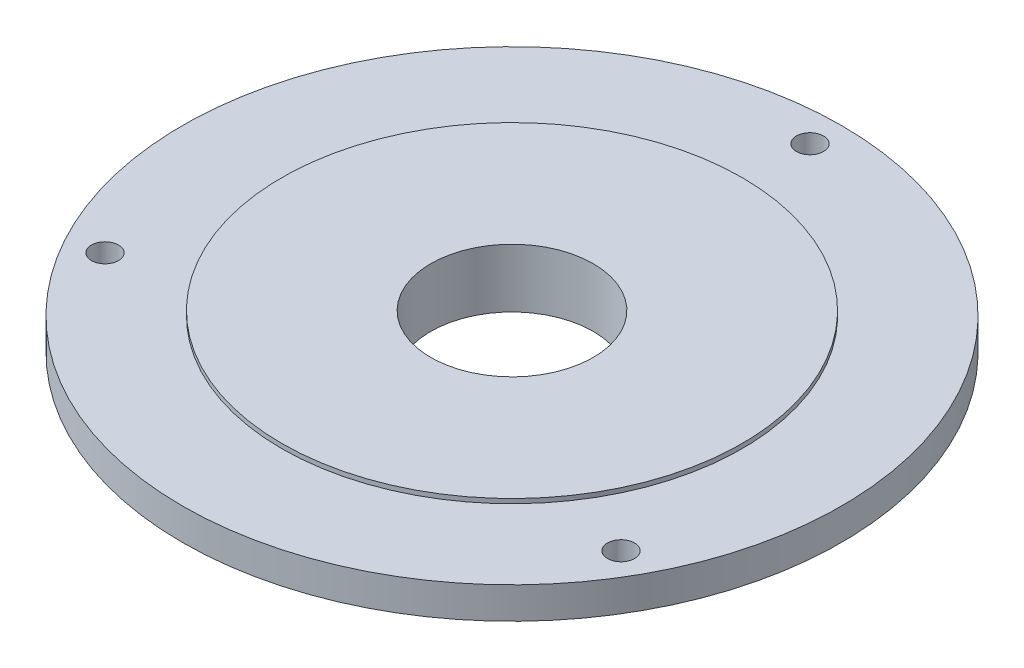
ISO-10303-21;
HEADER;
FILE_DESCRIPTION(('STEP AP214'),'2;1');
FILE_NAME('part.step','',(''),(''),'','','');
FILE_SCHEMA(('AUTOMOTIVE_DESIGN { 1 0 10303 214 1 1 1 1 }'));
ENDSEC;
DATA;
#1=APPLICATION_CONTEXT('core data for automotive mechanical design processes');
#2=APPLICATION_PROTOCOL_DEFINITION('international standard','automotive_design',2000,#1);
#3=PRODUCT_CONTEXT('',#1,'mechanical');
#4=PRODUCT('Part','Part','',(#3));
#5=PRODUCT_RELATED_PRODUCT_CATEGORY('part','',(#4));
#6=PRODUCT_DEFINITION_FORMATION('','',#4);
#7=PRODUCT_DEFINITION_CONTEXT('part definition',#1,'design');
#8=PRODUCT_DEFINITION('design','',#6,#7);
#9=PRODUCT_DEFINITION_SHAPE('','',#8);
#10=(LENGTH_UNIT() NAMED_UNIT(*) SI_UNIT(.MILLI.,.METRE.));
#11=(NAMED_UNIT(*) PLANE_ANGLE_UNIT() SI_UNIT($,.RADIAN.));
#12=(NAMED_UNIT(*) SI_UNIT($,.STERADIAN.) SOLID_ANGLE_UNIT());
#13=UNCERTAINTY_MEASURE_WITH_UNIT(LENGTH_MEASURE(1.E-05),#10,'distance_accuracy_value','');
#14=(GEOMETRIC_REPRESENTATION_CONTEXT(3) GLOBAL_UNCERTAINTY_ASSIGNED_CONTEXT((#13)) GLOBAL_UNIT_ASSIGNED_CONTEXT((#10,
#11,#12)) REPRESENTATION_CONTEXT('',''));
#15=CARTESIAN_POINT('',(0.,0.,0.));
#16=DIRECTION('',(0.,0.,1.));
#17=DIRECTION('',(1.,0.,0.));
#18=AXIS2_PLACEMENT_3D('',#15,#16,#17);
#19=CARTESIAN_POINT('',(0.,0.,0.));
#20=DIRECTION('',(0.,-1.,0.));
#21=DIRECTION('',(0.,0.,-1.));
#22=AXIS2_PLACEMENT_3D('',#19,#20,#21);
#23=CYLINDRICAL_SURFACE('',#22,25.5);
#24=CARTESIAN_POINT('',(0.,38.3859311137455,0.));
#25=DIRECTION('',(0.,-1.,0.));
#26=DIRECTION('',(0.,0.,-1.));
#27=AXIS2_PLACEMENT_3D('',#24,#25,#26);
#28=CIRCLE('',#27,25.5);
#29=CARTESIAN_POINT('',(0.,38.3859311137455,-25.5));
#30=VERTEX_POINT('',#29);
#31=EDGE_CURVE('E10',#30,#30,#28,.T.);
#32=ORIENTED_EDGE('',*,*,#31,.T.);
#33=EDGE_LOOP('',(#32));
#34=FACE_BOUND('',#33,.T.);
#35=CARTESIAN_POINT('',(0.,37.8859311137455,0.));
#36=DIRECTION('',(0.,-1.,0.));
#37=DIRECTION('',(0.,0.,-1.));
#38=AXIS2_PLACEMENT_3D('',#35,#36,#37);
#39=CIRCLE('',#38,25.5);
#40=CARTESIAN_POINT('',(0.,37.8859311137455,-25.5));
#41=VERTEX_POINT('',#40);
#42=EDGE_CURVE('E72',#41,#41,#39,.T.);
#43=ORIENTED_EDGE('',*,*,#42,.F.);
#44=EDGE_LOOP('',(#43));
#45=FACE_BOUND('',#44,.T.);
#46=ADVANCED_FACE('F37',(#34,#45),#23,.T.);
#47=CARTESIAN_POINT('',(9.,38.3859311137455,0.));
#48=DIRECTION('',(0.,1.,0.));
#49=DIRECTION('',(0.,0.,1.));
#50=AXIS2_PLACEMENT_3D('',#47,#48,#49);
#51=PLANE('',#50);
#52=CARTESIAN_POINT('',(0.,38.3859311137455,0.));
#53=DIRECTION('',(0.,-1.,0.));
#54=DIRECTION('',(0.,0.,-1.));
#55=AXIS2_PLACEMENT_3D('',#52,#53,#54);
#56=CIRCLE('',#55,9.);
#57=CARTESIAN_POINT('',(0.,38.3859311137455,-9.));
#58=VERTEX_POINT('',#57);
#59=EDGE_CURVE('E44',#58,#58,#56,.T.);
#60=ORIENTED_EDGE('',*,*,#59,.T.);
#61=EDGE_LOOP('',(#60));
#62=FACE_BOUND('',#61,.T.);
#63=ORIENTED_EDGE('',*,*,#31,.F.);
#64=EDGE_LOOP('',(#63));
#65=FACE_BOUND('',#64,.T.);
#66=ADVANCED_FACE('F144',(#62,#65),#51,.T.);
#67=CARTESIAN_POINT('',(0.,0.,0.));
#68=DIRECTION('',(0.,-1.,0.));
#69=DIRECTION('',(0.,0.,-1.));
#70=AXIS2_PLACEMENT_3D('',#67,#68,#69);
#71=CYLINDRICAL_SURFACE('',#70,9.);
#72=CARTESIAN_POINT('',(0.,31.8859311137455,0.));
#73=DIRECTION('',(0.,-1.,0.));
#74=DIRECTION('',(0.,0.,-1.));
#75=AXIS2_PLACEMENT_3D('',#72,#73,#74);
#76=CIRCLE('',#75,9.);
#77=CARTESIAN_POINT('',(0.,31.8859311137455,-9.));
#78=VERTEX_POINT('',#77);
#79=EDGE_CURVE('E49',#78,#78,#76,.T.);
#80=ORIENTED_EDGE('',*,*,#79,.T.);
#81=EDGE_LOOP('',(#80));
#82=FACE_BOUND('',#81,.T.);
#83=ORIENTED_EDGE('',*,*,#59,.F.);
#84=EDGE_LOOP('',(#83));
#85=FACE_BOUND('',#84,.T.);
#86=ADVANCED_FACE('F138',(#82,#85),#71,.F.);
#87=CARTESIAN_POINT('',(9.,31.8859311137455,0.));
#88=DIRECTION('',(0.,-1.,0.));
#89=DIRECTION('',(0.,0.,-1.));
#90=AXIS2_PLACEMENT_3D('',#87,#88,#89);
#91=PLANE('',#90);
#92=CARTESIAN_POINT('',(0.,31.8859311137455,0.));
#93=DIRECTION('',(0.,-1.,0.));
#94=DIRECTION('',(0.,0.,-1.));
#95=AXIS2_PLACEMENT_3D('',#92,#93,#94);
#96=CIRCLE('',#95,14.25);
#97=CARTESIAN_POINT('',(0.,31.8859311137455,-14.25));
#98=VERTEX_POINT('',#97);
#99=EDGE_CURVE('E54',#98,#98,#96,.T.);
#100=ORIENTED_EDGE('',*,*,#99,.T.);
#101=EDGE_LOOP('',(#100));
#102=FACE_BOUND('',#101,.T.);
#103=ORIENTED_EDGE('',*,*,#79,.F.);
#104=EDGE_LOOP('',(#103));
#105=FACE_BOUND('',#104,.T.);
#106=ADVANCED_FACE('F132',(#102,#105),#91,.T.);
#107=CARTESIAN_POINT('',(0.,0.,0.));
#108=DIRECTION('',(0.,-1.,0.));
#109=DIRECTION('',(0.,0.,-1.));
#110=AXIS2_PLACEMENT_3D('',#107,#108,#109);
#111=CYLINDRICAL_SURFACE('',#110,14.25);
#112=CARTESIAN_POINT('',(0.,34.3859311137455,0.));
#113=DIRECTION('',(0.,-1.,0.));
#114=DIRECTION('',(0.,0.,-1.));
#115=AXIS2_PLACEMENT_3D('',#112,#113,#114);
#116=CIRCLE('',#115,14.25);
#117=CARTESIAN_POINT('',(0.,34.3859311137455,-14.25));
#118=VERTEX_POINT('',#117);
#119=EDGE_CURVE('E60',#118,#118,#116,.T.);
#120=ORIENTED_EDGE('',*,*,#119,.T.);
#121=EDGE_LOOP('',(#120));
#122=FACE_BOUND('',#121,.T.);
#123=ORIENTED_EDGE('',*,*,#99,.F.);
#124=EDGE_LOOP('',(#123));
#125=FACE_BOUND('',#124,.T.);
#126=ADVANCED_FACE('F125',(#122,#125),#111,.T.);
#127=CARTESIAN_POINT('',(14.25,34.3859311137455,0.));
#128=DIRECTION('',(0.,-1.,0.));
#129=DIRECTION('',(0.,0.,-1.));
#130=AXIS2_PLACEMENT_3D('',#127,#128,#129);
#131=PLANE('',#130);
#132=CARTESIAN_POINT('',(0.,34.3859311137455,-33.));
#133=DIRECTION('',(0.,-1.,0.));
#134=DIRECTION('',(0.,0.,-1.));
#135=AXIS2_PLACEMENT_3D('',#132,#133,#134);
#136=CIRCLE('',#135,1.5);
#137=CARTESIAN_POINT('',(0.,34.3859311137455,-34.5));
#138=VERTEX_POINT('',#137);
#139=EDGE_CURVE('E76',#138,#138,#136,.T.);
#140=ORIENTED_EDGE('',*,*,#139,.F.);
#141=EDGE_LOOP('',(#140));
#142=FACE_BOUND('',#141,.T.);
#143=CARTESIAN_POINT('',(28.5788383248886,34.3859311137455,16.4999999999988));
#144=DIRECTION('',(0.,-1.,0.));
#145=DIRECTION('',(0.,0.,-1.));
#146=AXIS2_PLACEMENT_3D('',#143,#144,#145);
#147=CIRCLE('',#146,1.5000000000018);
#148=CARTESIAN_POINT('',(28.5788383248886,34.3859311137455,14.999999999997));
#149=VERTEX_POINT('',#148);
#150=EDGE_CURVE('E80',#149,#149,#147,.T.);
#151=ORIENTED_EDGE('',*,*,#150,.F.);
#152=EDGE_LOOP('',(#151));
#153=FACE_BOUND('',#152,.T.);
#154=CARTESIAN_POINT('',(-28.5788383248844,34.3859311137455,16.5000000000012));
#155=DIRECTION('',(0.,-1.,0.));
#156=DIRECTION('',(0.,0.,-1.));
#157=AXIS2_PLACEMENT_3D('',#154,#155,#156);
#158=CIRCLE('',#157,1.50000000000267);
#159=CARTESIAN_POINT('',(-28.5788383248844,34.3859311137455,14.9999999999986));
#160=VERTEX_POINT('',#159);
#161=EDGE_CURVE('E84',#160,#160,#158,.T.);
#162=ORIENTED_EDGE('',*,*,#161,.F.);
#163=EDGE_LOOP('',(#162));
#164=FACE_BOUND('',#163,.T.);
#165=CARTESIAN_POINT('',(0.,34.3859311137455,0.));
#166=DIRECTION('',(0.,-1.,0.));
#167=DIRECTION('',(0.,0.,-1.));
#168=AXIS2_PLACEMENT_3D('',#165,#166,#167);
#169=CIRCLE('',#168,36.5);
#170=CARTESIAN_POINT('',(0.,34.3859311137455,-36.5));
#171=VERTEX_POINT('',#170);
#172=EDGE_CURVE('E64',#171,#171,#169,.T.);
#173=ORIENTED_EDGE('',*,*,#172,.T.);
#174=EDGE_LOOP('',(#173));
#175=FACE_BOUND('',#174,.T.);
#176=ORIENTED_EDGE('',*,*,#119,.F.);
#177=EDGE_LOOP('',(#176));
#178=FACE_BOUND('',#177,.T.);
#179=ADVANCED_FACE('F119',(#142,#153,#164,#175,#178),#131,.T.);
#180=CARTESIAN_POINT('',(0.,0.,0.));
#181=DIRECTION('',(0.,-1.,0.));
#182=DIRECTION('',(0.,0.,-1.));
#183=AXIS2_PLACEMENT_3D('',#180,#181,#182);
#184=CYLINDRICAL_SURFACE('',#183,36.5);
#185=CARTESIAN_POINT('',(0.,37.8859311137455,0.));
#186=DIRECTION('',(0.,-1.,0.));
#187=DIRECTION('',(0.,0.,-1.));
#188=AXIS2_PLACEMENT_3D('',#185,#186,#187);
#189=CIRCLE('',#188,36.5);
#190=CARTESIAN_POINT('',(0.,37.8859311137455,-36.5));
#191=VERTEX_POINT('',#190);
#192=EDGE_CURVE('E68',#191,#191,#189,.T.);
#193=ORIENTED_EDGE('',*,*,#192,.T.);
#194=EDGE_LOOP('',(#193));
#195=FACE_BOUND('',#194,.T.);
#196=ORIENTED_EDGE('',*,*,#172,.F.);
#197=EDGE_LOOP('',(#196));
#198=FACE_BOUND('',#197,.T.);
#199=ADVANCED_FACE('F107',(#195,#198),#184,.T.);
#200=CARTESIAN_POINT('',(25.5,37.8859311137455,0.));
#201=DIRECTION('',(0.,1.,0.));
#202=DIRECTION('',(0.,0.,1.));
#203=AXIS2_PLACEMENT_3D('',#200,#201,#202);
#204=PLANE('',#203);
#205=CARTESIAN_POINT('',(0.,37.8859311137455,-33.));
#206=DIRECTION('',(0.,1.,0.));
#207=DIRECTION('',(0.,0.,1.));
#208=AXIS2_PLACEMENT_3D('',#205,#206,#207);
#209=CIRCLE('',#208,1.5);
#210=CARTESIAN_POINT('',(0.,37.8859311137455,-31.5));
#211=VERTEX_POINT('',#210);
#212=EDGE_CURVE('E88',#211,#211,#209,.T.);
#213=ORIENTED_EDGE('',*,*,#212,.F.);
#214=EDGE_LOOP('',(#213));
#215=FACE_BOUND('',#214,.T.);
#216=CARTESIAN_POINT('',(28.5788383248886,37.8859311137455,16.4999999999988));
#217=DIRECTION('',(0.,1.,0.));
#218=DIRECTION('',(0.,0.,1.));
#219=AXIS2_PLACEMENT_3D('',#216,#217,#218);
#220=CIRCLE('',#219,1.5000000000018);
#221=CARTESIAN_POINT('',(28.5788383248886,37.8859311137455,18.0000000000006));
#222=VERTEX_POINT('',#221);
#223=EDGE_CURVE('E93',#222,#222,#220,.T.);
#224=ORIENTED_EDGE('',*,*,#223,.F.);
#225=EDGE_LOOP('',(#224));
#226=FACE_BOUND('',#225,.T.);
#227=CARTESIAN_POINT('',(-28.5788383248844,37.8859311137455,16.5000000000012));
#228=DIRECTION('',(0.,1.,0.));
#229=DIRECTION('',(0.,0.,1.));
#230=AXIS2_PLACEMENT_3D('',#227,#228,#229);
#231=CIRCLE('',#230,1.50000000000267);
#232=CARTESIAN_POINT('',(-28.5788383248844,37.8859311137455,18.0000000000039));
#233=VERTEX_POINT('',#232);
#234=EDGE_CURVE('E89',#233,#233,#231,.T.);
#235=ORIENTED_EDGE('',*,*,#234,.F.);
#236=EDGE_LOOP('',(#235));
#237=FACE_BOUND('',#236,.T.);
#238=ORIENTED_EDGE('',*,*,#42,.T.);
#239=EDGE_LOOP('',(#238));
#240=FACE_BOUND('',#239,.T.);
#241=ORIENTED_EDGE('',*,*,#192,.F.);
#242=EDGE_LOOP('',(#241));
#243=FACE_BOUND('',#242,.T.);
#244=ADVANCED_FACE('F103',(#215,#226,#237,#240,#243),#204,.T.);
#245=CARTESIAN_POINT('',(-28.5788383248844,31.8859311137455,16.5000000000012));
#246=DIRECTION('',(0.,1.,0.));
#247=DIRECTION('',(0.,0.,1.));
#248=AXIS2_PLACEMENT_3D('',#245,#246,#247);
#249=CYLINDRICAL_SURFACE('',#248,1.50000000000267);
#250=ORIENTED_EDGE('',*,*,#161,.T.);
#251=EDGE_LOOP('',(#250));
#252=FACE_BOUND('',#251,.T.);
#253=ORIENTED_EDGE('',*,*,#234,.T.);
#254=EDGE_LOOP('',(#253));
#255=FACE_BOUND('',#254,.T.);
#256=ADVANCED_FACE('F106',(#252,#255),#249,.F.);
#257=CARTESIAN_POINT('',(28.5788383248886,31.8859311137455,16.4999999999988));
#258=DIRECTION('',(0.,1.,0.));
#259=DIRECTION('',(0.,0.,1.));
#260=AXIS2_PLACEMENT_3D('',#257,#258,#259);
#261=CYLINDRICAL_SURFACE('',#260,1.5000000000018);
#262=ORIENTED_EDGE('',*,*,#150,.T.);
#263=EDGE_LOOP('',(#262));
#264=FACE_BOUND('',#263,.T.);
#265=ORIENTED_EDGE('',*,*,#223,.T.);
#266=EDGE_LOOP('',(#265));
#267=FACE_BOUND('',#266,.T.);
#268=ADVANCED_FACE('F200',(#264,#267),#261,.F.);
#269=CARTESIAN_POINT('',(0.,31.8859311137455,-33.));
#270=DIRECTION('',(0.,1.,0.));
#271=DIRECTION('',(0.,0.,1.));
#272=AXIS2_PLACEMENT_3D('',#269,#270,#271);
#273=CYLINDRICAL_SURFACE('',#272,1.5);
#274=ORIENTED_EDGE('',*,*,#139,.T.);
#275=EDGE_LOOP('',(#274));
#276=FACE_BOUND('',#275,.T.);
#277=ORIENTED_EDGE('',*,*,#212,.T.);
#278=EDGE_LOOP('',(#277));
#279=FACE_BOUND('',#278,.T.);
#280=ADVANCED_FACE('F101',(#276,#279),#273,.F.);
#281=CLOSED_SHELL('',(#46,#66,#86,#106,#126,#179,#199,#244,#256,#268,#280));
#282=MANIFOLD_SOLID_BREP('B2',#281);
#283=ADVANCED_BREP_SHAPE_REPRESENTATION('',(#18,#282),#14);
#284=SHAPE_DEFINITION_REPRESENTATION(#9,#283);
ENDSEC;
END-ISO-10303-21;
